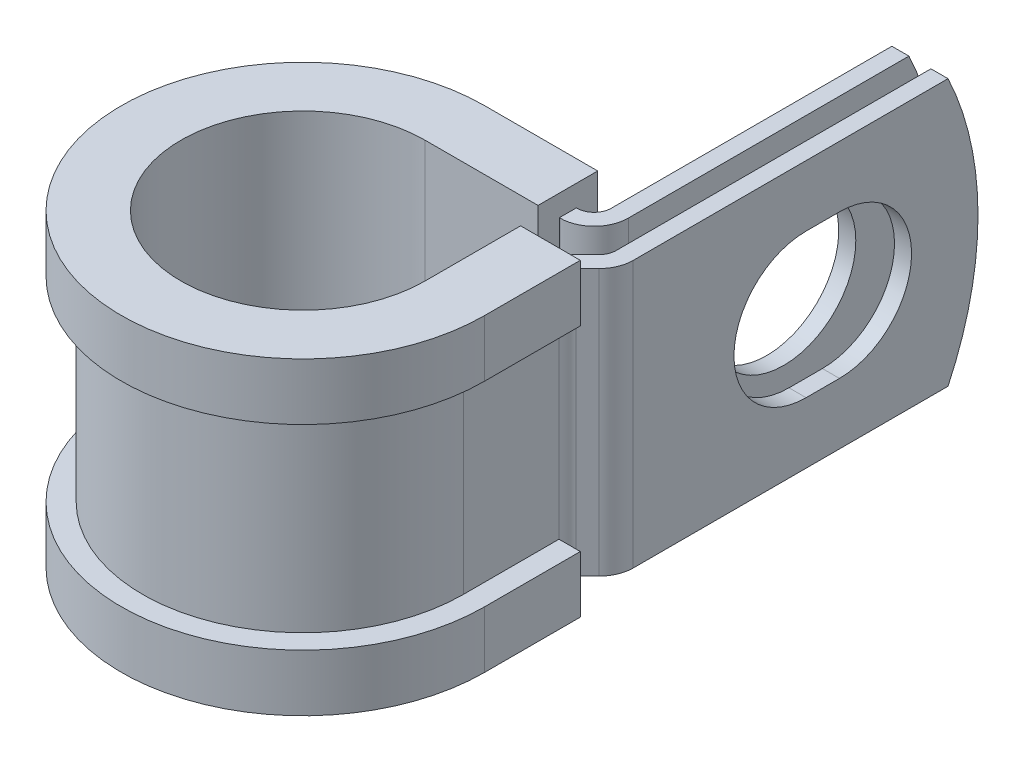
from build123d import *

# Parameters (mm, degrees)
EXTRUDE_THIN1_DEPTH = 9.525
SKETCH2_R           = 5.1562
CUT_EXTRUDE1_DEPTH  = 1.2192
CUT_EXTRUDE2_DEPTH  = 1.2192
CUT_EXTRUDE3_DEPTH  = 42.739665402


with BuildPart() as part:
    # Sketch1 → Extrude-Thin1 (new, symmetric)
    with BuildSketch(Plane(origin=(0, 0, 0), x_dir=(1, 0, 0), z_dir=(0, 1, 0))):
        with BuildLine():
            Line((12.1463698, 34.8996), (12.1463698, 10.2489))
            ThreePointArc((12.1463698, 10.2489), (12.053563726, 9.782332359), (11.789274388, 9.386795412))
            Line((11.789274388, 9.386795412), (10.963090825, 8.560611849))
            ThreePointArc((10.963090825, 8.560611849), (10.434512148, 7.769537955), (10.2489, 6.836402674))
            Line((10.2489, 6.836402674), (10.2489, 0))
            ThreePointArc((10.2489, 0), (-7.24706669, -7.24706669), (0, 10.2489))
            Line((0, 10.2489), (8.1331698, 10.2489))
            ThreePointArc((8.1331698, 10.2489), (9.857378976, 10.963090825), (10.5715698, 12.6873))
            Line((10.5715698, 12.6873), (10.5715698, 34.8996))
            Line((10.5715698, 34.8996), (9.3523698, 34.8996))
            Line((9.3523698, 34.8996), (9.3523698, 12.6873))
            ThreePointArc((9.3523698, 12.6873), (8.995274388, 11.825195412), (8.1331698, 11.4681))
            Line((8.1331698, 11.4681), (0, 11.4681))
            ThreePointArc((0, 11.4681), (-8.109171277, -8.109171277), (11.4681, 0))
            Line((11.4681, 0), (11.4681, 6.836402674))
            ThreePointArc((11.4681, 6.836402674), (11.560906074, 7.302970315), (11.825195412, 7.698507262))
            Line((11.825195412, 7.698507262), (12.651378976, 8.524690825))
            ThreePointArc((12.651378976, 8.524690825), (13.179957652, 9.315764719), (13.3655698, 10.2489))
            Line((13.3655698, 10.2489), (13.3655698, 34.8996))
            Line((13.3655698, 34.8996), (12.1463698, 34.8996))
        make_face()
    extrude(amount=EXTRUDE_THIN1_DEPTH, both=True)

    # Sketch2 → Cut-Extrude1 (cut)
    with BuildSketch(Plane.ZY.offset(-9.3523698)):
        with Locations((-23.7998, 0)):
            Circle(SKETCH2_R)
    extrude(amount=-CUT_EXTRUDE1_DEPTH, mode=Mode.SUBTRACT)

    # Sketch3 → Cut-Extrude2 (cut)
    with BuildSketch(Plane(origin=(13.3655698, 0, 0), x_dir=(0, 0, -1), z_dir=(1, 0, 0))):
        with BuildLine():
            Line((22.606, 5.1562), (24.9936, 5.1562))
            ThreePointArc((24.9936, 5.1562), (30.1498, 0), (24.9936, -5.1562))
            Line((24.9936, -5.1562), (22.606, -5.1562))
            ThreePointArc((22.606, -5.1562), (17.4498, 0), (22.606, 5.1562))
        make_face()
    extrude(amount=-CUT_EXTRUDE2_DEPTH, mode=Mode.SUBTRACT)

    # Sketch4 → Cut-Extrude3 (cut, through all)
    with BuildSketch(Plane.ZY.offset(-9.3523698)):
        with BuildLine():
            Line((-32.755063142, 9.525), (-34.8996, 9.525))
            Line((-34.8996, 9.525), (-34.8996, -2.73e-07))
            ThreePointArc((-34.8996, -2.73e-07), (-34.356838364, 4.881717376), (-32.755063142, 9.525))
        make_face()
        with BuildLine():
            ThreePointArc((-32.755063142, -9.525), (-34.356838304, -4.881717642), (-34.8996, -2.73e-07))
            Line((-34.8996, -2.73e-07), (-34.8996, -9.525))
            Line((-34.8996, -9.525), (-32.755063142, -9.525))
        make_face()
    extrude(amount=-CUT_EXTRUDE3_DEPTH, mode=Mode.SUBTRACT)

    # Sweep1: sweep along a path in Sketch6
    with BuildLine(Plane(origin=(0, 9.525, 0), x_dir=(1, 0, 0), z_dir=(0, 1, 0))) as sweep1_path:
        Line((8.7249, 6.836402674), (8.7249, 0))
        ThreePointArc((8.7249, 0), (-6.169435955, -6.169435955), (0, 8.7249))
        Line((0, 8.7249), (8.0823698, 8.7249))
    # Sketch5 → Sweep1 (sweep)
    with BuildSketch(Plane(origin=(0, 0, -6.836402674), x_dir=(-1, 0, 0), z_dir=(0, 0, -1))):
        Polygon((-11.4681, 9.525), (-10.2489, 9.525), (-10.2489, -9.525), (-11.4681, -9.525), (-11.4681, -6.985), (-12.9921, -6.985), (-12.9921, -11.049), (-8.7249, -11.049), (-8.7249, 11.049), (-12.9921, 11.049), (-12.9921, 6.985), (-11.4681, 6.985), align=None)
    sweep(path=sweep1_path.line)


solid = part.part
